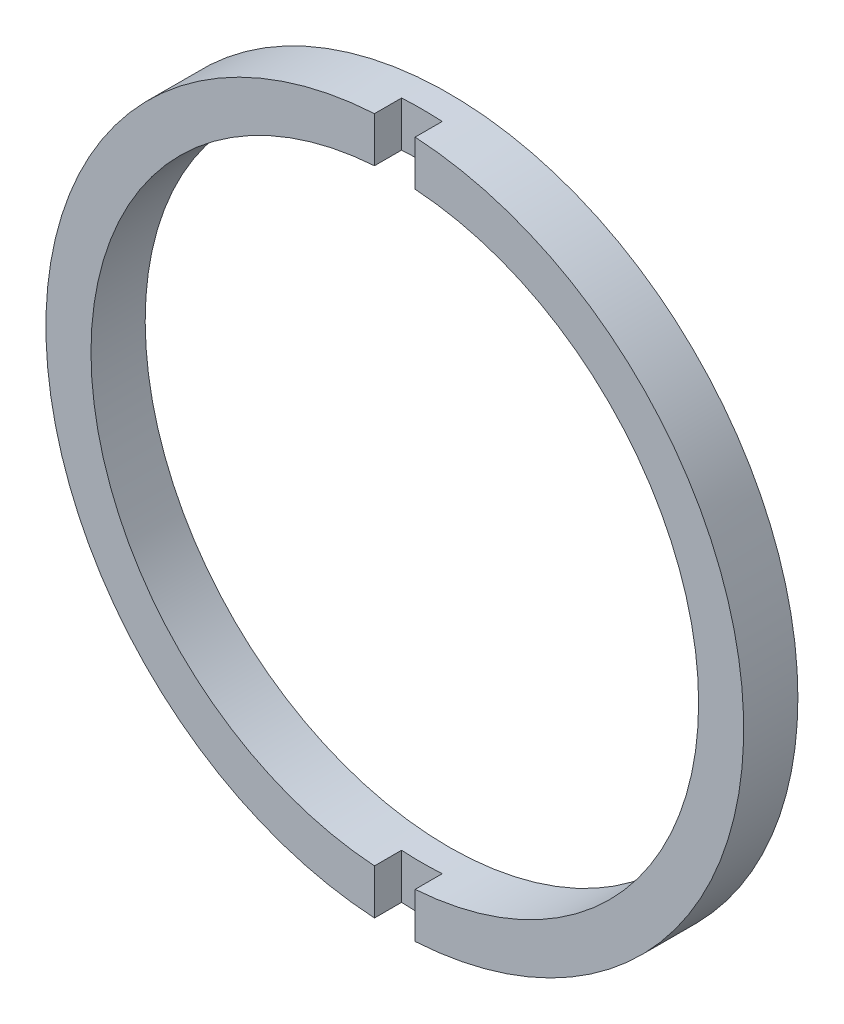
ISO-10303-21;
HEADER;
FILE_DESCRIPTION(('STEP AP214'),'2;1');
FILE_NAME('part.step','',(''),(''),'','','');
FILE_SCHEMA(('AUTOMOTIVE_DESIGN { 1 0 10303 214 1 1 1 1 }'));
ENDSEC;
DATA;
#1=APPLICATION_CONTEXT('core data for automotive mechanical design processes');
#2=APPLICATION_PROTOCOL_DEFINITION('international standard','automotive_design',2000,#1);
#3=PRODUCT_CONTEXT('',#1,'mechanical');
#4=PRODUCT('Part','Part','',(#3));
#5=PRODUCT_RELATED_PRODUCT_CATEGORY('part','',(#4));
#6=PRODUCT_DEFINITION_FORMATION('','',#4);
#7=PRODUCT_DEFINITION_CONTEXT('part definition',#1,'design');
#8=PRODUCT_DEFINITION('design','',#6,#7);
#9=PRODUCT_DEFINITION_SHAPE('','',#8);
#10=(LENGTH_UNIT() NAMED_UNIT(*) SI_UNIT(.MILLI.,.METRE.));
#11=(NAMED_UNIT(*) PLANE_ANGLE_UNIT() SI_UNIT($,.RADIAN.));
#12=(NAMED_UNIT(*) SI_UNIT($,.STERADIAN.) SOLID_ANGLE_UNIT());
#13=UNCERTAINTY_MEASURE_WITH_UNIT(LENGTH_MEASURE(1.E-05),#10,'distance_accuracy_value','');
#14=(GEOMETRIC_REPRESENTATION_CONTEXT(3) GLOBAL_UNCERTAINTY_ASSIGNED_CONTEXT((#13)) GLOBAL_UNIT_ASSIGNED_CONTEXT((#10,
#11,#12)) REPRESENTATION_CONTEXT('',''));
#15=CARTESIAN_POINT('',(0.,0.,0.));
#16=DIRECTION('',(0.,0.,1.));
#17=DIRECTION('',(1.,0.,0.));
#18=AXIS2_PLACEMENT_3D('',#15,#16,#17);
#19=CARTESIAN_POINT('',(0.,0.,4.));
#20=DIRECTION('',(0.,0.,1.));
#21=DIRECTION('',(1.,0.,0.));
#22=AXIS2_PLACEMENT_3D('',#19,#20,#21);
#23=PLANE('',#22);
#24=DIRECTION('',(0.,1.,0.));
#25=VECTOR('',#24,1.);
#26=CARTESIAN_POINT('',(1.5,-29.1614471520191,4.));
#27=LINE('',#26,#25);
#28=CARTESIAN_POINT('',(1.5,-25.7062735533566,4.));
#29=VERTEX_POINT('',#28);
#30=CARTESIAN_POINT('',(1.5,-22.3728514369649,4.));
#31=VERTEX_POINT('',#30);
#32=EDGE_CURVE('E104',#29,#31,#27,.T.);
#33=ORIENTED_EDGE('',*,*,#32,.F.);
#34=CARTESIAN_POINT('',(0.,0.,4.));
#35=DIRECTION('',(0.,0.,1.));
#36=DIRECTION('',(1.,0.,0.));
#37=AXIS2_PLACEMENT_3D('',#34,#35,#36);
#38=CIRCLE('',#37,25.75);
#39=CARTESIAN_POINT('',(1.5,25.7062735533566,4.));
#40=VERTEX_POINT('',#39);
#41=EDGE_CURVE('E116',#29,#40,#38,.T.);
#42=ORIENTED_EDGE('',*,*,#41,.T.);
#43=CARTESIAN_POINT('',(1.5,22.3728514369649,4.));
#44=VERTEX_POINT('',#43);
#45=EDGE_CURVE('E120',#44,#40,#27,.T.);
#46=ORIENTED_EDGE('',*,*,#45,.F.);
#47=CARTESIAN_POINT('',(0.,0.,4.));
#48=DIRECTION('',(0.,0.,1.));
#49=DIRECTION('',(1.,0.,0.));
#50=AXIS2_PLACEMENT_3D('',#47,#48,#49);
#51=CIRCLE('',#50,22.4230792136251);
#52=EDGE_CURVE('E118',#31,#44,#51,.T.);
#53=ORIENTED_EDGE('',*,*,#52,.F.);
#54=EDGE_LOOP('',(#33,#42,#46,#53));
#55=FACE_BOUND('',#54,.T.);
#56=ADVANCED_FACE('F38',(#55),#23,.T.);
#57=DIRECTION('',(0.,-1.,0.));
#58=VECTOR('',#57,1.);
#59=CARTESIAN_POINT('',(-1.5,-29.1614471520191,4.));
#60=LINE('',#59,#58);
#61=CARTESIAN_POINT('',(-1.5,25.7062735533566,4.));
#62=VERTEX_POINT('',#61);
#63=CARTESIAN_POINT('',(-1.5,22.3728514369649,4.));
#64=VERTEX_POINT('',#63);
#65=EDGE_CURVE('E152',#62,#64,#60,.T.);
#66=ORIENTED_EDGE('',*,*,#65,.F.);
#67=CARTESIAN_POINT('',(-1.5,-25.7062735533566,4.));
#68=VERTEX_POINT('',#67);
#69=EDGE_CURVE('E125',#62,#68,#38,.T.);
#70=ORIENTED_EDGE('',*,*,#69,.T.);
#71=CARTESIAN_POINT('',(-1.5,-22.3728514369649,4.));
#72=VERTEX_POINT('',#71);
#73=EDGE_CURVE('E119',#72,#68,#60,.T.);
#74=ORIENTED_EDGE('',*,*,#73,.F.);
#75=EDGE_CURVE('E131',#64,#72,#51,.T.);
#76=ORIENTED_EDGE('',*,*,#75,.F.);
#77=EDGE_LOOP('',(#66,#70,#74,#76));
#78=FACE_BOUND('',#77,.T.);
#79=ADVANCED_FACE('F181',(#78),#23,.T.);
#80=CARTESIAN_POINT('',(0.,0.,0.));
#81=DIRECTION('',(0.,0.,1.));
#82=DIRECTION('',(1.,0.,0.));
#83=AXIS2_PLACEMENT_3D('',#80,#81,#82);
#84=PLANE('',#83);
#85=CARTESIAN_POINT('',(0.,0.,0.));
#86=DIRECTION('',(0.,0.,1.));
#87=DIRECTION('',(1.,0.,0.));
#88=AXIS2_PLACEMENT_3D('',#85,#86,#87);
#89=CIRCLE('',#88,25.75);
#90=CARTESIAN_POINT('',(25.75,0.,0.));
#91=VERTEX_POINT('',#90);
#92=EDGE_CURVE('E126',#91,#91,#89,.T.);
#93=ORIENTED_EDGE('',*,*,#92,.F.);
#94=EDGE_LOOP('',(#93));
#95=FACE_BOUND('',#94,.T.);
#96=CARTESIAN_POINT('',(0.,0.,0.));
#97=DIRECTION('',(0.,0.,1.));
#98=DIRECTION('',(1.,0.,0.));
#99=AXIS2_PLACEMENT_3D('',#96,#97,#98);
#100=CIRCLE('',#99,22.4230792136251);
#101=CARTESIAN_POINT('',(22.4230792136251,0.,0.));
#102=VERTEX_POINT('',#101);
#103=EDGE_CURVE('E109',#102,#102,#100,.T.);
#104=ORIENTED_EDGE('',*,*,#103,.T.);
#105=EDGE_LOOP('',(#104));
#106=FACE_BOUND('',#105,.T.);
#107=ADVANCED_FACE('F199',(#95,#106),#84,.F.);
#108=CARTESIAN_POINT('',(0.,0.,4.));
#109=DIRECTION('',(0.,0.,-1.));
#110=DIRECTION('',(-1.,0.,0.));
#111=AXIS2_PLACEMENT_3D('',#108,#109,#110);
#112=CYLINDRICAL_SURFACE('',#111,25.75);
#113=CARTESIAN_POINT('',(0.,0.,2.));
#114=DIRECTION('',(0.,0.,-1.));
#115=DIRECTION('',(-1.,0.,0.));
#116=AXIS2_PLACEMENT_3D('',#113,#114,#115);
#117=CIRCLE('',#116,25.75);
#118=CARTESIAN_POINT('',(-1.5,25.7062735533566,2.));
#119=VERTEX_POINT('',#118);
#120=CARTESIAN_POINT('',(1.5,25.7062735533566,2.));
#121=VERTEX_POINT('',#120);
#122=EDGE_CURVE('E167',#119,#121,#117,.T.);
#123=ORIENTED_EDGE('',*,*,#122,.T.);
#124=DIRECTION('',(0.,0.,-1.));
#125=VECTOR('',#124,1.);
#126=CARTESIAN_POINT('',(1.5,25.7062735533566,4.));
#127=LINE('',#126,#125);
#128=EDGE_CURVE('E110',#121,#40,#127,.F.);
#129=ORIENTED_EDGE('',*,*,#128,.T.);
#130=ORIENTED_EDGE('',*,*,#41,.F.);
#131=DIRECTION('',(0.,0.,-1.));
#132=VECTOR('',#131,1.);
#133=CARTESIAN_POINT('',(1.5,-25.7062735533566,4.));
#134=LINE('',#133,#132);
#135=CARTESIAN_POINT('',(1.5,-25.7062735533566,2.));
#136=VERTEX_POINT('',#135);
#137=EDGE_CURVE('E101',#29,#136,#134,.T.);
#138=ORIENTED_EDGE('',*,*,#137,.T.);
#139=CARTESIAN_POINT('',(-1.5,-25.7062735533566,2.));
#140=VERTEX_POINT('',#139);
#141=EDGE_CURVE('E168',#136,#140,#117,.T.);
#142=ORIENTED_EDGE('',*,*,#141,.T.);
#143=DIRECTION('',(0.,0.,-1.));
#144=VECTOR('',#143,1.);
#145=CARTESIAN_POINT('',(-1.5,-25.7062735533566,4.));
#146=LINE('',#145,#144);
#147=EDGE_CURVE('E164',#140,#68,#146,.F.);
#148=ORIENTED_EDGE('',*,*,#147,.T.);
#149=ORIENTED_EDGE('',*,*,#69,.F.);
#150=DIRECTION('',(0.,0.,-1.));
#151=VECTOR('',#150,1.);
#152=CARTESIAN_POINT('',(-1.5,25.7062735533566,4.));
#153=LINE('',#152,#151);
#154=EDGE_CURVE('E161',#62,#119,#153,.T.);
#155=ORIENTED_EDGE('',*,*,#154,.T.);
#156=EDGE_LOOP('',(#123,#129,#130,#138,#142,#148,#149,#155));
#157=FACE_BOUND('',#156,.T.);
#158=ORIENTED_EDGE('',*,*,#92,.T.);
#159=EDGE_LOOP('',(#158));
#160=FACE_BOUND('',#159,.T.);
#161=ADVANCED_FACE('F40',(#157,#160),#112,.T.);
#162=CARTESIAN_POINT('',(0.,0.,4.));
#163=DIRECTION('',(0.,0.,-1.));
#164=DIRECTION('',(-1.,0.,0.));
#165=AXIS2_PLACEMENT_3D('',#162,#163,#164);
#166=CYLINDRICAL_SURFACE('',#165,22.4230792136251);
#167=DIRECTION('',(0.,0.,-1.));
#168=VECTOR('',#167,1.);
#169=CARTESIAN_POINT('',(1.5,22.3728514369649,4.));
#170=LINE('',#169,#168);
#171=CARTESIAN_POINT('',(1.5,22.3728514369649,2.));
#172=VERTEX_POINT('',#171);
#173=EDGE_CURVE('E11',#172,#44,#170,.F.);
#174=ORIENTED_EDGE('',*,*,#173,.F.);
#175=CARTESIAN_POINT('',(0.,0.,2.));
#176=DIRECTION('',(0.,0.,-1.));
#177=DIRECTION('',(-1.,0.,0.));
#178=AXIS2_PLACEMENT_3D('',#175,#176,#177);
#179=CIRCLE('',#178,22.4230792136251);
#180=CARTESIAN_POINT('',(-1.5,22.3728514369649,2.));
#181=VERTEX_POINT('',#180);
#182=EDGE_CURVE('E138',#181,#172,#179,.T.);
#183=ORIENTED_EDGE('',*,*,#182,.F.);
#184=DIRECTION('',(0.,0.,-1.));
#185=VECTOR('',#184,1.);
#186=CARTESIAN_POINT('',(-1.5,22.3728514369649,4.));
#187=LINE('',#186,#185);
#188=EDGE_CURVE('E46',#64,#181,#187,.T.);
#189=ORIENTED_EDGE('',*,*,#188,.F.);
#190=ORIENTED_EDGE('',*,*,#75,.T.);
#191=DIRECTION('',(0.,0.,-1.));
#192=VECTOR('',#191,1.);
#193=CARTESIAN_POINT('',(-1.5,-22.3728514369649,4.));
#194=LINE('',#193,#192);
#195=CARTESIAN_POINT('',(-1.5,-22.3728514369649,2.));
#196=VERTEX_POINT('',#195);
#197=EDGE_CURVE('E137',#196,#72,#194,.F.);
#198=ORIENTED_EDGE('',*,*,#197,.F.);
#199=CARTESIAN_POINT('',(1.5,-22.3728514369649,2.));
#200=VERTEX_POINT('',#199);
#201=EDGE_CURVE('E129',#200,#196,#179,.T.);
#202=ORIENTED_EDGE('',*,*,#201,.F.);
#203=DIRECTION('',(0.,0.,-1.));
#204=VECTOR('',#203,1.);
#205=CARTESIAN_POINT('',(1.5,-22.3728514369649,4.));
#206=LINE('',#205,#204);
#207=EDGE_CURVE('E140',#31,#200,#206,.T.);
#208=ORIENTED_EDGE('',*,*,#207,.F.);
#209=ORIENTED_EDGE('',*,*,#52,.T.);
#210=EDGE_LOOP('',(#174,#183,#189,#190,#198,#202,#208,#209));
#211=FACE_BOUND('',#210,.T.);
#212=ORIENTED_EDGE('',*,*,#103,.F.);
#213=EDGE_LOOP('',(#212));
#214=FACE_BOUND('',#213,.T.);
#215=ADVANCED_FACE('F154',(#211,#214),#166,.F.);
#216=CARTESIAN_POINT('',(0.,0.,2.));
#217=DIRECTION('',(0.,0.,-1.));
#218=DIRECTION('',(-1.,0.,0.));
#219=AXIS2_PLACEMENT_3D('',#216,#217,#218);
#220=PLANE('',#219);
#221=DIRECTION('',(0.,1.,0.));
#222=VECTOR('',#221,1.);
#223=CARTESIAN_POINT('',(1.5,-29.1614471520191,2.));
#224=LINE('',#223,#222);
#225=EDGE_CURVE('E61',#136,#200,#224,.T.);
#226=ORIENTED_EDGE('',*,*,#225,.T.);
#227=ORIENTED_EDGE('',*,*,#201,.T.);
#228=DIRECTION('',(0.,-1.,0.));
#229=VECTOR('',#228,1.);
#230=CARTESIAN_POINT('',(-1.5,-29.1614471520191,2.));
#231=LINE('',#230,#229);
#232=EDGE_CURVE('E171',#196,#140,#231,.T.);
#233=ORIENTED_EDGE('',*,*,#232,.T.);
#234=ORIENTED_EDGE('',*,*,#141,.F.);
#235=EDGE_LOOP('',(#226,#227,#233,#234));
#236=FACE_BOUND('',#235,.T.);
#237=ADVANCED_FACE('F174',(#236),#220,.F.);
#238=CARTESIAN_POINT('',(-1.5,-29.1614471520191,2.));
#239=DIRECTION('',(-1.,0.,0.));
#240=DIRECTION('',(0.,0.,1.));
#241=AXIS2_PLACEMENT_3D('',#238,#239,#240);
#242=PLANE('',#241);
#243=ORIENTED_EDGE('',*,*,#232,.F.);
#244=ORIENTED_EDGE('',*,*,#197,.T.);
#245=ORIENTED_EDGE('',*,*,#73,.T.);
#246=ORIENTED_EDGE('',*,*,#147,.F.);
#247=EDGE_LOOP('',(#243,#244,#245,#246));
#248=FACE_BOUND('',#247,.T.);
#249=ADVANCED_FACE('F184',(#248),#242,.F.);
#250=CARTESIAN_POINT('',(1.5,-29.1614471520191,2.));
#251=DIRECTION('',(1.,0.,0.));
#252=DIRECTION('',(0.,0.,-1.));
#253=AXIS2_PLACEMENT_3D('',#250,#251,#252);
#254=PLANE('',#253);
#255=ORIENTED_EDGE('',*,*,#32,.T.);
#256=ORIENTED_EDGE('',*,*,#207,.T.);
#257=ORIENTED_EDGE('',*,*,#225,.F.);
#258=ORIENTED_EDGE('',*,*,#137,.F.);
#259=EDGE_LOOP('',(#255,#256,#257,#258));
#260=FACE_BOUND('',#259,.T.);
#261=ADVANCED_FACE('F103',(#260),#254,.F.);
#262=EDGE_CURVE('E147',#172,#121,#224,.T.);
#263=ORIENTED_EDGE('',*,*,#262,.F.);
#264=ORIENTED_EDGE('',*,*,#173,.T.);
#265=ORIENTED_EDGE('',*,*,#45,.T.);
#266=ORIENTED_EDGE('',*,*,#128,.F.);
#267=EDGE_LOOP('',(#263,#264,#265,#266));
#268=FACE_BOUND('',#267,.T.);
#269=ADVANCED_FACE('F151',(#268),#254,.F.);
#270=ORIENTED_EDGE('',*,*,#65,.T.);
#271=ORIENTED_EDGE('',*,*,#188,.T.);
#272=EDGE_CURVE('E53',#119,#181,#231,.T.);
#273=ORIENTED_EDGE('',*,*,#272,.F.);
#274=ORIENTED_EDGE('',*,*,#154,.F.);
#275=EDGE_LOOP('',(#270,#271,#273,#274));
#276=FACE_BOUND('',#275,.T.);
#277=ADVANCED_FACE('F183',(#276),#242,.F.);
#278=ORIENTED_EDGE('',*,*,#272,.T.);
#279=ORIENTED_EDGE('',*,*,#182,.T.);
#280=ORIENTED_EDGE('',*,*,#262,.T.);
#281=ORIENTED_EDGE('',*,*,#122,.F.);
#282=EDGE_LOOP('',(#278,#279,#280,#281));
#283=FACE_BOUND('',#282,.T.);
#284=ADVANCED_FACE('F146',(#283),#220,.F.);
#285=CLOSED_SHELL('',(#56,#79,#107,#161,#215,#237,#249,#261,#269,#277,#284));
#286=MANIFOLD_SOLID_BREP('B2',#285);
#287=ADVANCED_BREP_SHAPE_REPRESENTATION('',(#18,#286),#14);
#288=SHAPE_DEFINITION_REPRESENTATION(#9,#287);
ENDSEC;
END-ISO-10303-21;
